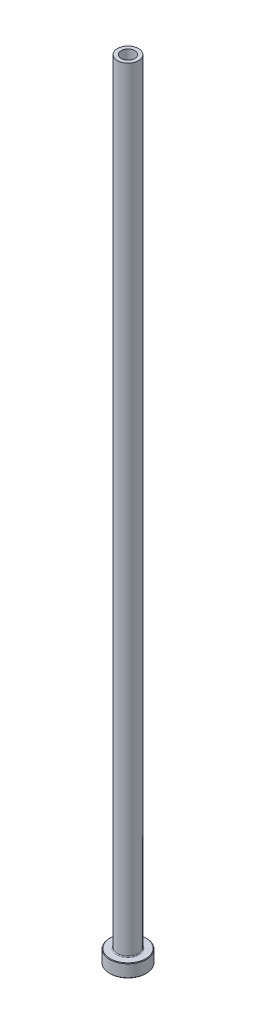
ISO-10303-21;
HEADER;
FILE_DESCRIPTION(('STEP AP214'),'2;1');
FILE_NAME('part.step','',(''),(''),'','','');
FILE_SCHEMA(('AUTOMOTIVE_DESIGN { 1 0 10303 214 1 1 1 1 }'));
ENDSEC;
DATA;
#1=APPLICATION_CONTEXT('core data for automotive mechanical design processes');
#2=APPLICATION_PROTOCOL_DEFINITION('international standard','automotive_design',2000,#1);
#3=PRODUCT_CONTEXT('',#1,'mechanical');
#4=PRODUCT('Part','Part','',(#3));
#5=PRODUCT_RELATED_PRODUCT_CATEGORY('part','',(#4));
#6=PRODUCT_DEFINITION_FORMATION('','',#4);
#7=PRODUCT_DEFINITION_CONTEXT('part definition',#1,'design');
#8=PRODUCT_DEFINITION('design','',#6,#7);
#9=PRODUCT_DEFINITION_SHAPE('','',#8);
#10=(LENGTH_UNIT() NAMED_UNIT(*) SI_UNIT(.MILLI.,.METRE.));
#11=(NAMED_UNIT(*) PLANE_ANGLE_UNIT() SI_UNIT($,.RADIAN.));
#12=(NAMED_UNIT(*) SI_UNIT($,.STERADIAN.) SOLID_ANGLE_UNIT());
#13=UNCERTAINTY_MEASURE_WITH_UNIT(LENGTH_MEASURE(1.E-05),#10,'distance_accuracy_value','');
#14=(GEOMETRIC_REPRESENTATION_CONTEXT(3) GLOBAL_UNCERTAINTY_ASSIGNED_CONTEXT((#13)) GLOBAL_UNIT_ASSIGNED_CONTEXT((#10,
#11,#12)) REPRESENTATION_CONTEXT('',''));
#15=CARTESIAN_POINT('',(0.,0.,0.));
#16=DIRECTION('',(0.,0.,1.));
#17=DIRECTION('',(1.,0.,0.));
#18=AXIS2_PLACEMENT_3D('',#15,#16,#17);
#19=CARTESIAN_POINT('',(0.,92.1876809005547,0.));
#20=DIRECTION('',(0.,1.,0.));
#21=DIRECTION('',(0.,0.,1.));
#22=AXIS2_PLACEMENT_3D('',#19,#20,#21);
#23=CYLINDRICAL_SURFACE('',#22,2.60000000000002);
#24=CARTESIAN_POINT('',(0.,300.,0.));
#25=DIRECTION('',(0.,1.,0.));
#26=DIRECTION('',(0.,0.,1.));
#27=AXIS2_PLACEMENT_3D('',#24,#25,#26);
#28=CIRCLE('',#27,2.60000000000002);
#29=CARTESIAN_POINT('',(0.,300.,2.60000000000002));
#30=VERTEX_POINT('',#29);
#31=EDGE_CURVE('E62',#30,#30,#28,.T.);
#32=ORIENTED_EDGE('',*,*,#31,.T.);
#33=EDGE_LOOP('',(#32));
#34=FACE_BOUND('',#33,.T.);
#35=CARTESIAN_POINT('',(0.,255.,0.));
#36=DIRECTION('',(0.,1.,0.));
#37=DIRECTION('',(0.,0.,1.));
#38=AXIS2_PLACEMENT_3D('',#35,#36,#37);
#39=CIRCLE('',#38,2.60000000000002);
#40=CARTESIAN_POINT('',(0.,255.,2.60000000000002));
#41=VERTEX_POINT('',#40);
#42=EDGE_CURVE('E71',#41,#41,#39,.T.);
#43=ORIENTED_EDGE('',*,*,#42,.F.);
#44=EDGE_LOOP('',(#43));
#45=FACE_BOUND('',#44,.T.);
#46=ADVANCED_FACE('F30',(#34,#45),#23,.F.);
#47=CARTESIAN_POINT('',(-2.60000000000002,300.,0.));
#48=DIRECTION('',(0.,1.,0.));
#49=DIRECTION('',(0.,0.,1.));
#50=AXIS2_PLACEMENT_3D('',#47,#48,#49);
#51=PLANE('',#50);
#52=CARTESIAN_POINT('',(0.,300.,0.));
#53=DIRECTION('',(0.,1.,0.));
#54=DIRECTION('',(0.,0.,1.));
#55=AXIS2_PLACEMENT_3D('',#52,#53,#54);
#56=CIRCLE('',#55,4.00000000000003);
#57=CARTESIAN_POINT('',(0.,300.,4.00000000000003));
#58=VERTEX_POINT('',#57);
#59=EDGE_CURVE('E65',#58,#58,#56,.T.);
#60=ORIENTED_EDGE('',*,*,#59,.T.);
#61=EDGE_LOOP('',(#60));
#62=FACE_BOUND('',#61,.T.);
#63=ORIENTED_EDGE('',*,*,#31,.F.);
#64=EDGE_LOOP('',(#63));
#65=FACE_BOUND('',#64,.T.);
#66=ADVANCED_FACE('F79',(#62,#65),#51,.T.);
#67=CARTESIAN_POINT('',(0.,92.1876809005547,0.));
#68=DIRECTION('',(0.,1.,0.));
#69=DIRECTION('',(0.,0.,1.));
#70=AXIS2_PLACEMENT_3D('',#67,#68,#69);
#71=CYLINDRICAL_SURFACE('',#70,4.00000000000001);
#72=CARTESIAN_POINT('',(0.,5.3,0.));
#73=DIRECTION('',(0.,1.,0.));
#74=DIRECTION('',(0.,0.,1.));
#75=AXIS2_PLACEMENT_3D('',#72,#73,#74);
#76=CIRCLE('',#75,4.00000000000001);
#77=CARTESIAN_POINT('',(0.,5.3,4.00000000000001));
#78=VERTEX_POINT('',#77);
#79=EDGE_CURVE('E59',#78,#78,#76,.T.);
#80=ORIENTED_EDGE('',*,*,#79,.T.);
#81=EDGE_LOOP('',(#80));
#82=FACE_BOUND('',#81,.T.);
#83=ORIENTED_EDGE('',*,*,#59,.F.);
#84=EDGE_LOOP('',(#83));
#85=FACE_BOUND('',#84,.T.);
#86=ADVANCED_FACE('F85',(#82,#85),#71,.T.);
#87=CARTESIAN_POINT('',(-3.99999999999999,5.,0.));
#88=DIRECTION('',(0.,1.,0.));
#89=DIRECTION('',(0.,0.,1.));
#90=AXIS2_PLACEMENT_3D('',#87,#88,#89);
#91=PLANE('',#90);
#92=CARTESIAN_POINT('',(0.,5.,0.));
#93=DIRECTION('',(0.,1.,0.));
#94=DIRECTION('',(0.,0.,1.));
#95=AXIS2_PLACEMENT_3D('',#92,#93,#94);
#96=CIRCLE('',#95,6.79999999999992);
#97=CARTESIAN_POINT('',(0.,5.,6.79999999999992));
#98=VERTEX_POINT('',#97);
#99=EDGE_CURVE('E53',#98,#98,#96,.T.);
#100=ORIENTED_EDGE('',*,*,#99,.T.);
#101=EDGE_LOOP('',(#100));
#102=FACE_BOUND('',#101,.T.);
#103=CARTESIAN_POINT('',(0.,5.,0.));
#104=DIRECTION('',(0.,1.,0.));
#105=DIRECTION('',(0.,0.,1.));
#106=AXIS2_PLACEMENT_3D('',#103,#104,#105);
#107=CIRCLE('',#106,4.30000000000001);
#108=CARTESIAN_POINT('',(0.,5.,4.30000000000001));
#109=VERTEX_POINT('',#108);
#110=EDGE_CURVE('E56',#109,#109,#107,.F.);
#111=ORIENTED_EDGE('',*,*,#110,.T.);
#112=EDGE_LOOP('',(#111));
#113=FACE_BOUND('',#112,.T.);
#114=ADVANCED_FACE('F111',(#102,#113),#91,.T.);
#115=CARTESIAN_POINT('',(0.,92.1876809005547,0.));
#116=DIRECTION('',(0.,1.,0.));
#117=DIRECTION('',(0.,0.,1.));
#118=AXIS2_PLACEMENT_3D('',#115,#116,#117);
#119=CYLINDRICAL_SURFACE('',#118,6.99999999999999);
#120=CARTESIAN_POINT('',(0.,4.79999999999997,0.));
#121=DIRECTION('',(0.,1.,0.));
#122=DIRECTION('',(0.,0.,1.));
#123=AXIS2_PLACEMENT_3D('',#120,#121,#122);
#124=CIRCLE('',#123,6.99999999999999);
#125=CARTESIAN_POINT('',(0.,4.79999999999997,6.99999999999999));
#126=VERTEX_POINT('',#125);
#127=EDGE_CURVE('E45',#126,#126,#124,.F.);
#128=ORIENTED_EDGE('',*,*,#127,.T.);
#129=EDGE_LOOP('',(#128));
#130=FACE_BOUND('',#129,.T.);
#131=CARTESIAN_POINT('',(0.,0.20000000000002,0.));
#132=DIRECTION('',(0.,-1.,0.));
#133=DIRECTION('',(0.,0.,-1.));
#134=AXIS2_PLACEMENT_3D('',#131,#132,#133);
#135=CIRCLE('',#134,6.99999999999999);
#136=CARTESIAN_POINT('',(0.,0.20000000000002,-6.99999999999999));
#137=VERTEX_POINT('',#136);
#138=EDGE_CURVE('E50',#137,#137,#135,.F.);
#139=ORIENTED_EDGE('',*,*,#138,.T.);
#140=EDGE_LOOP('',(#139));
#141=FACE_BOUND('',#140,.T.);
#142=ADVANCED_FACE('F108',(#130,#141),#119,.T.);
#143=CARTESIAN_POINT('',(-6.99999999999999,0.,0.));
#144=DIRECTION('',(0.,-1.,0.));
#145=DIRECTION('',(0.,0.,-1.));
#146=AXIS2_PLACEMENT_3D('',#143,#144,#145);
#147=PLANE('',#146);
#148=CARTESIAN_POINT('',(0.,0.,0.));
#149=DIRECTION('',(0.,-1.,0.));
#150=DIRECTION('',(0.,0.,-1.));
#151=AXIS2_PLACEMENT_3D('',#148,#149,#150);
#152=CIRCLE('',#151,3.34999999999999);
#153=CARTESIAN_POINT('',(0.,0.,-3.34999999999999));
#154=VERTEX_POINT('',#153);
#155=EDGE_CURVE('E37',#154,#154,#152,.F.);
#156=ORIENTED_EDGE('',*,*,#155,.T.);
#157=EDGE_LOOP('',(#156));
#158=FACE_BOUND('',#157,.T.);
#159=CARTESIAN_POINT('',(0.,0.,0.));
#160=DIRECTION('',(0.,-1.,0.));
#161=DIRECTION('',(0.,0.,-1.));
#162=AXIS2_PLACEMENT_3D('',#159,#160,#161);
#163=CIRCLE('',#162,6.79999999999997);
#164=CARTESIAN_POINT('',(0.,0.,-6.79999999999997));
#165=VERTEX_POINT('',#164);
#166=EDGE_CURVE('E41',#165,#165,#163,.T.);
#167=ORIENTED_EDGE('',*,*,#166,.T.);
#168=EDGE_LOOP('',(#167));
#169=FACE_BOUND('',#168,.T.);
#170=ADVANCED_FACE('F110',(#158,#169),#147,.T.);
#171=CARTESIAN_POINT('',(0.,92.1876809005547,0.));
#172=DIRECTION('',(0.,1.,0.));
#173=DIRECTION('',(0.,0.,1.));
#174=AXIS2_PLACEMENT_3D('',#171,#172,#173);
#175=CYLINDRICAL_SURFACE('',#174,2.85);
#176=CARTESIAN_POINT('',(0.,0.499999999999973,0.));
#177=DIRECTION('',(0.,-1.,0.));
#178=DIRECTION('',(0.,0.,-1.));
#179=AXIS2_PLACEMENT_3D('',#176,#177,#178);
#180=CIRCLE('',#179,2.85);
#181=CARTESIAN_POINT('',(0.,0.499999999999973,-2.85));
#182=VERTEX_POINT('',#181);
#183=EDGE_CURVE('E10',#182,#182,#180,.T.);
#184=ORIENTED_EDGE('',*,*,#183,.T.);
#185=EDGE_LOOP('',(#184));
#186=FACE_BOUND('',#185,.T.);
#187=CARTESIAN_POINT('',(0.,243.,0.));
#188=DIRECTION('',(0.,1.,0.));
#189=DIRECTION('',(0.,0.,1.));
#190=AXIS2_PLACEMENT_3D('',#187,#188,#189);
#191=CIRCLE('',#190,2.85000000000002);
#192=CARTESIAN_POINT('',(0.,243.,2.85000000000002));
#193=VERTEX_POINT('',#192);
#194=EDGE_CURVE('E68',#193,#193,#191,.T.);
#195=ORIENTED_EDGE('',*,*,#194,.T.);
#196=EDGE_LOOP('',(#195));
#197=FACE_BOUND('',#196,.T.);
#198=ADVANCED_FACE('F118',(#186,#197),#175,.F.);
#199=CARTESIAN_POINT('',(0.,243.,0.));
#200=DIRECTION('',(0.,-1.,0.));
#201=DIRECTION('',(0.,0.,-1.));
#202=AXIS2_PLACEMENT_3D('',#199,#200,#201);
#203=CONICAL_SURFACE('',#202,2.85000000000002,0.0208303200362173);
#204=ORIENTED_EDGE('',*,*,#42,.T.);
#205=EDGE_LOOP('',(#204));
#206=FACE_BOUND('',#205,.T.);
#207=ORIENTED_EDGE('',*,*,#194,.F.);
#208=EDGE_LOOP('',(#207));
#209=FACE_BOUND('',#208,.T.);
#210=ADVANCED_FACE('F75',(#206,#209),#203,.F.);
#211=CARTESIAN_POINT('',(0.,5.3,0.));
#212=DIRECTION('',(0.,1.,0.));
#213=DIRECTION('',(0.,0.,1.));
#214=AXIS2_PLACEMENT_3D('',#211,#212,#213);
#215=TOROIDAL_SURFACE('',#214,4.30000000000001,0.3);
#216=ORIENTED_EDGE('',*,*,#110,.F.);
#217=EDGE_LOOP('',(#216));
#218=FACE_BOUND('',#217,.T.);
#219=ORIENTED_EDGE('',*,*,#79,.F.);
#220=EDGE_LOOP('',(#219));
#221=FACE_BOUND('',#220,.T.);
#222=ADVANCED_FACE('F90',(#218,#221),#215,.F.);
#223=CARTESIAN_POINT('',(0.,5.,0.));
#224=DIRECTION('',(0.,-1.,0.));
#225=DIRECTION('',(0.,0.,-1.));
#226=AXIS2_PLACEMENT_3D('',#223,#224,#225);
#227=CONICAL_SURFACE('',#226,6.79999999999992,0.785398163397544);
#228=ORIENTED_EDGE('',*,*,#127,.F.);
#229=EDGE_LOOP('',(#228));
#230=FACE_BOUND('',#229,.T.);
#231=ORIENTED_EDGE('',*,*,#99,.F.);
#232=EDGE_LOOP('',(#231));
#233=FACE_BOUND('',#232,.T.);
#234=ADVANCED_FACE('F93',(#230,#233),#227,.T.);
#235=CARTESIAN_POINT('',(0.,0.20000000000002,0.));
#236=DIRECTION('',(0.,1.,0.));
#237=DIRECTION('',(0.,0.,1.));
#238=AXIS2_PLACEMENT_3D('',#235,#236,#237);
#239=CONICAL_SURFACE('',#238,6.99999999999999,0.78539816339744);
#240=ORIENTED_EDGE('',*,*,#166,.F.);
#241=EDGE_LOOP('',(#240));
#242=FACE_BOUND('',#241,.T.);
#243=ORIENTED_EDGE('',*,*,#138,.F.);
#244=EDGE_LOOP('',(#243));
#245=FACE_BOUND('',#244,.T.);
#246=ADVANCED_FACE('F96',(#242,#245),#239,.T.);
#247=CARTESIAN_POINT('',(0.,0.,0.));
#248=DIRECTION('',(0.,-1.,0.));
#249=DIRECTION('',(0.,0.,-1.));
#250=AXIS2_PLACEMENT_3D('',#247,#248,#249);
#251=CONICAL_SURFACE('',#250,3.34999999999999,0.785398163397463);
#252=ORIENTED_EDGE('',*,*,#183,.F.);
#253=EDGE_LOOP('',(#252));
#254=FACE_BOUND('',#253,.T.);
#255=ORIENTED_EDGE('',*,*,#155,.F.);
#256=EDGE_LOOP('',(#255));
#257=FACE_BOUND('',#256,.T.);
#258=ADVANCED_FACE('F32',(#254,#257),#251,.F.);
#259=CLOSED_SHELL('',(#46,#66,#86,#114,#142,#170,#198,#210,#222,#234,#246,#258));
#260=MANIFOLD_SOLID_BREP('B2',#259);
#261=ADVANCED_BREP_SHAPE_REPRESENTATION('',(#18,#260),#14);
#262=SHAPE_DEFINITION_REPRESENTATION(#9,#261);
ENDSEC;
END-ISO-10303-21;
